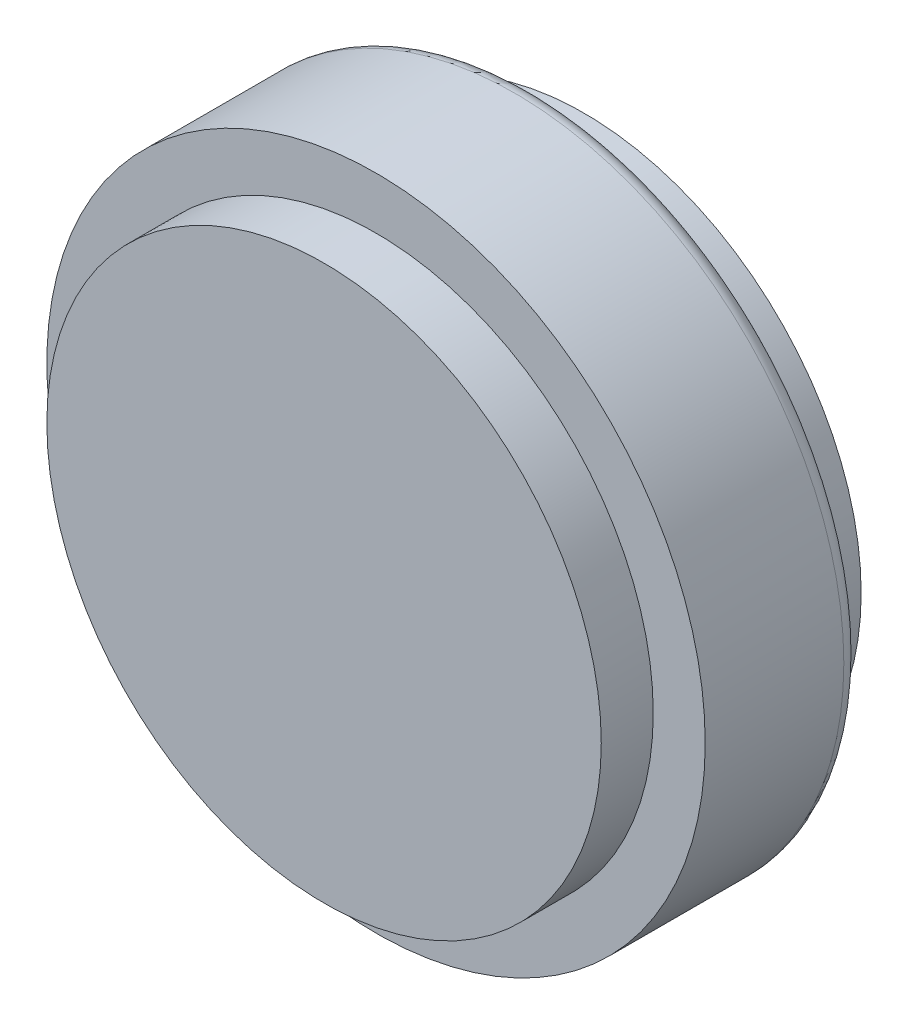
ISO-10303-21;
HEADER;
FILE_DESCRIPTION(('STEP AP214'),'2;1');
FILE_NAME('part.step','',(''),(''),'','','');
FILE_SCHEMA(('AUTOMOTIVE_DESIGN { 1 0 10303 214 1 1 1 1 }'));
ENDSEC;
DATA;
#1=APPLICATION_CONTEXT('core data for automotive mechanical design processes');
#2=APPLICATION_PROTOCOL_DEFINITION('international standard','automotive_design',2000,#1);
#3=PRODUCT_CONTEXT('',#1,'mechanical');
#4=PRODUCT('Part','Part','',(#3));
#5=PRODUCT_RELATED_PRODUCT_CATEGORY('part','',(#4));
#6=PRODUCT_DEFINITION_FORMATION('','',#4);
#7=PRODUCT_DEFINITION_CONTEXT('part definition',#1,'design');
#8=PRODUCT_DEFINITION('design','',#6,#7);
#9=PRODUCT_DEFINITION_SHAPE('','',#8);
#10=(LENGTH_UNIT() NAMED_UNIT(*) SI_UNIT(.MILLI.,.METRE.));
#11=(NAMED_UNIT(*) PLANE_ANGLE_UNIT() SI_UNIT($,.RADIAN.));
#12=(NAMED_UNIT(*) SI_UNIT($,.STERADIAN.) SOLID_ANGLE_UNIT());
#13=UNCERTAINTY_MEASURE_WITH_UNIT(LENGTH_MEASURE(1.E-05),#10,'distance_accuracy_value','');
#14=(GEOMETRIC_REPRESENTATION_CONTEXT(3) GLOBAL_UNCERTAINTY_ASSIGNED_CONTEXT((#13)) GLOBAL_UNIT_ASSIGNED_CONTEXT((#10,
#11,#12)) REPRESENTATION_CONTEXT('',''));
#15=CARTESIAN_POINT('',(0.,0.,0.));
#16=DIRECTION('',(0.,0.,1.));
#17=DIRECTION('',(1.,0.,0.));
#18=AXIS2_PLACEMENT_3D('',#15,#16,#17);
#19=CARTESIAN_POINT('',(0.,0.,7.49278691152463));
#20=DIRECTION('',(0.,0.,-1.));
#21=DIRECTION('',(-1.,0.,0.));
#22=AXIS2_PLACEMENT_3D('',#19,#20,#21);
#23=PLANE('',#22);
#24=CARTESIAN_POINT('',(0.,0.,7.49278691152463));
#25=DIRECTION('',(0.,0.,1.));
#26=DIRECTION('',(1.,0.,0.));
#27=AXIS2_PLACEMENT_3D('',#24,#25,#26);
#28=CIRCLE('',#27,32.);
#29=CARTESIAN_POINT('',(32.,0.,7.49278691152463));
#30=VERTEX_POINT('',#29);
#31=EDGE_CURVE('E49',#30,#30,#28,.T.);
#32=ORIENTED_EDGE('',*,*,#31,.T.);
#33=EDGE_LOOP('',(#32));
#34=FACE_BOUND('',#33,.T.);
#35=ADVANCED_FACE('F38',(#34),#23,.F.);
#36=CARTESIAN_POINT('',(0.,0.,7.49278691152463));
#37=DIRECTION('',(0.,0.,1.));
#38=DIRECTION('',(1.,0.,0.));
#39=AXIS2_PLACEMENT_3D('',#36,#37,#38);
#40=CYLINDRICAL_SURFACE('',#39,32.);
#41=ORIENTED_EDGE('',*,*,#31,.F.);
#42=EDGE_LOOP('',(#41));
#43=FACE_BOUND('',#42,.T.);
#44=CARTESIAN_POINT('',(0.,0.,1.49278691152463));
#45=DIRECTION('',(0.,0.,1.));
#46=DIRECTION('',(1.,0.,0.));
#47=AXIS2_PLACEMENT_3D('',#44,#45,#46);
#48=CIRCLE('',#47,32.);
#49=CARTESIAN_POINT('',(32.,0.,1.49278691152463));
#50=VERTEX_POINT('',#49);
#51=EDGE_CURVE('E53',#50,#50,#48,.T.);
#52=ORIENTED_EDGE('',*,*,#51,.T.);
#53=EDGE_LOOP('',(#52));
#54=FACE_BOUND('',#53,.T.);
#55=ADVANCED_FACE('F82',(#43,#54),#40,.T.);
#56=CARTESIAN_POINT('',(0.,32.,1.49278691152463));
#57=DIRECTION('',(0.,0.,-1.));
#58=DIRECTION('',(-1.,0.,0.));
#59=AXIS2_PLACEMENT_3D('',#56,#57,#58);
#60=PLANE('',#59);
#61=ORIENTED_EDGE('',*,*,#51,.F.);
#62=EDGE_LOOP('',(#61));
#63=FACE_BOUND('',#62,.T.);
#64=CARTESIAN_POINT('',(0.,0.,1.49278691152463));
#65=DIRECTION('',(0.,0.,1.));
#66=DIRECTION('',(1.,0.,0.));
#67=AXIS2_PLACEMENT_3D('',#64,#65,#66);
#68=CIRCLE('',#67,38.);
#69=CARTESIAN_POINT('',(38.,0.,1.49278691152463));
#70=VERTEX_POINT('',#69);
#71=EDGE_CURVE('E58',#70,#70,#68,.T.);
#72=ORIENTED_EDGE('',*,*,#71,.T.);
#73=EDGE_LOOP('',(#72));
#74=FACE_BOUND('',#73,.T.);
#75=ADVANCED_FACE('F87',(#63,#74),#60,.F.);
#76=CARTESIAN_POINT('',(0.,0.,7.49278691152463));
#77=DIRECTION('',(0.,0.,1.));
#78=DIRECTION('',(1.,0.,0.));
#79=AXIS2_PLACEMENT_3D('',#76,#77,#78);
#80=CYLINDRICAL_SURFACE('',#79,38.);
#81=CARTESIAN_POINT('',(0.,0.,-14.5072130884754));
#82=DIRECTION('',(0.,0.,1.));
#83=DIRECTION('',(1.,0.,0.));
#84=AXIS2_PLACEMENT_3D('',#81,#82,#83);
#85=CIRCLE('',#84,38.);
#86=CARTESIAN_POINT('',(38.,0.,-14.5072130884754));
#87=VERTEX_POINT('',#86);
#88=EDGE_CURVE('E45',#87,#87,#85,.T.);
#89=ORIENTED_EDGE('',*,*,#88,.T.);
#90=EDGE_LOOP('',(#89));
#91=FACE_BOUND('',#90,.T.);
#92=ORIENTED_EDGE('',*,*,#71,.F.);
#93=EDGE_LOOP('',(#92));
#94=FACE_BOUND('',#93,.T.);
#95=ADVANCED_FACE('F93',(#91,#94),#80,.T.);
#96=CARTESIAN_POINT('',(0.,32.,-16.5072130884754));
#97=DIRECTION('',(0.,0.,1.));
#98=DIRECTION('',(1.,0.,0.));
#99=AXIS2_PLACEMENT_3D('',#96,#97,#98);
#100=PLANE('',#99);
#101=CARTESIAN_POINT('',(0.,0.,-16.5072130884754));
#102=DIRECTION('',(0.,0.,1.));
#103=DIRECTION('',(1.,0.,0.));
#104=AXIS2_PLACEMENT_3D('',#101,#102,#103);
#105=CIRCLE('',#104,36.);
#106=CARTESIAN_POINT('',(36.,0.,-16.5072130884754));
#107=VERTEX_POINT('',#106);
#108=EDGE_CURVE('E10',#107,#107,#105,.F.);
#109=ORIENTED_EDGE('',*,*,#108,.T.);
#110=EDGE_LOOP('',(#109));
#111=FACE_BOUND('',#110,.T.);
#112=CARTESIAN_POINT('',(0.,0.,-16.5072130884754));
#113=DIRECTION('',(0.,0.,1.));
#114=DIRECTION('',(1.,0.,0.));
#115=AXIS2_PLACEMENT_3D('',#112,#113,#114);
#116=CIRCLE('',#115,32.);
#117=CARTESIAN_POINT('',(32.,0.,-16.5072130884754));
#118=VERTEX_POINT('',#117);
#119=EDGE_CURVE('E61',#118,#118,#116,.T.);
#120=ORIENTED_EDGE('',*,*,#119,.T.);
#121=EDGE_LOOP('',(#120));
#122=FACE_BOUND('',#121,.T.);
#123=ADVANCED_FACE('F78',(#111,#122),#100,.F.);
#124=CARTESIAN_POINT('',(0.,0.,7.49278691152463));
#125=DIRECTION('',(0.,0.,1.));
#126=DIRECTION('',(1.,0.,0.));
#127=AXIS2_PLACEMENT_3D('',#124,#125,#126);
#128=CYLINDRICAL_SURFACE('',#127,32.);
#129=ORIENTED_EDGE('',*,*,#119,.F.);
#130=EDGE_LOOP('',(#129));
#131=FACE_BOUND('',#130,.T.);
#132=CARTESIAN_POINT('',(0.,0.,-22.5072130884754));
#133=DIRECTION('',(0.,0.,1.));
#134=DIRECTION('',(1.,0.,0.));
#135=AXIS2_PLACEMENT_3D('',#132,#133,#134);
#136=CIRCLE('',#135,32.);
#137=CARTESIAN_POINT('',(32.,0.,-22.5072130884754));
#138=VERTEX_POINT('',#137);
#139=EDGE_CURVE('E64',#138,#138,#136,.T.);
#140=ORIENTED_EDGE('',*,*,#139,.T.);
#141=EDGE_LOOP('',(#140));
#142=FACE_BOUND('',#141,.T.);
#143=ADVANCED_FACE('F68',(#131,#142),#128,.T.);
#144=CARTESIAN_POINT('',(0.,0.,-22.5072130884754));
#145=DIRECTION('',(0.,0.,1.));
#146=DIRECTION('',(1.,0.,0.));
#147=AXIS2_PLACEMENT_3D('',#144,#145,#146);
#148=PLANE('',#147);
#149=ORIENTED_EDGE('',*,*,#139,.F.);
#150=EDGE_LOOP('',(#149));
#151=FACE_BOUND('',#150,.T.);
#152=ADVANCED_FACE('F70',(#151),#148,.F.);
#153=CARTESIAN_POINT('',(0.,0.,-14.5072130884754));
#154=DIRECTION('',(0.,0.,1.));
#155=DIRECTION('',(1.,0.,0.));
#156=AXIS2_PLACEMENT_3D('',#153,#154,#155);
#157=TOROIDAL_SURFACE('',#156,36.,2.);
#158=ORIENTED_EDGE('',*,*,#108,.F.);
#159=EDGE_LOOP('',(#158));
#160=FACE_BOUND('',#159,.T.);
#161=ORIENTED_EDGE('',*,*,#88,.F.);
#162=EDGE_LOOP('',(#161));
#163=FACE_BOUND('',#162,.T.);
#164=ADVANCED_FACE('F40',(#160,#163),#157,.T.);
#165=CLOSED_SHELL('',(#35,#55,#75,#95,#123,#143,#152,#164));
#166=MANIFOLD_SOLID_BREP('B2',#165);
#167=ADVANCED_BREP_SHAPE_REPRESENTATION('',(#18,#166),#14);
#168=SHAPE_DEFINITION_REPRESENTATION(#9,#167);
ENDSEC;
END-ISO-10303-21;
